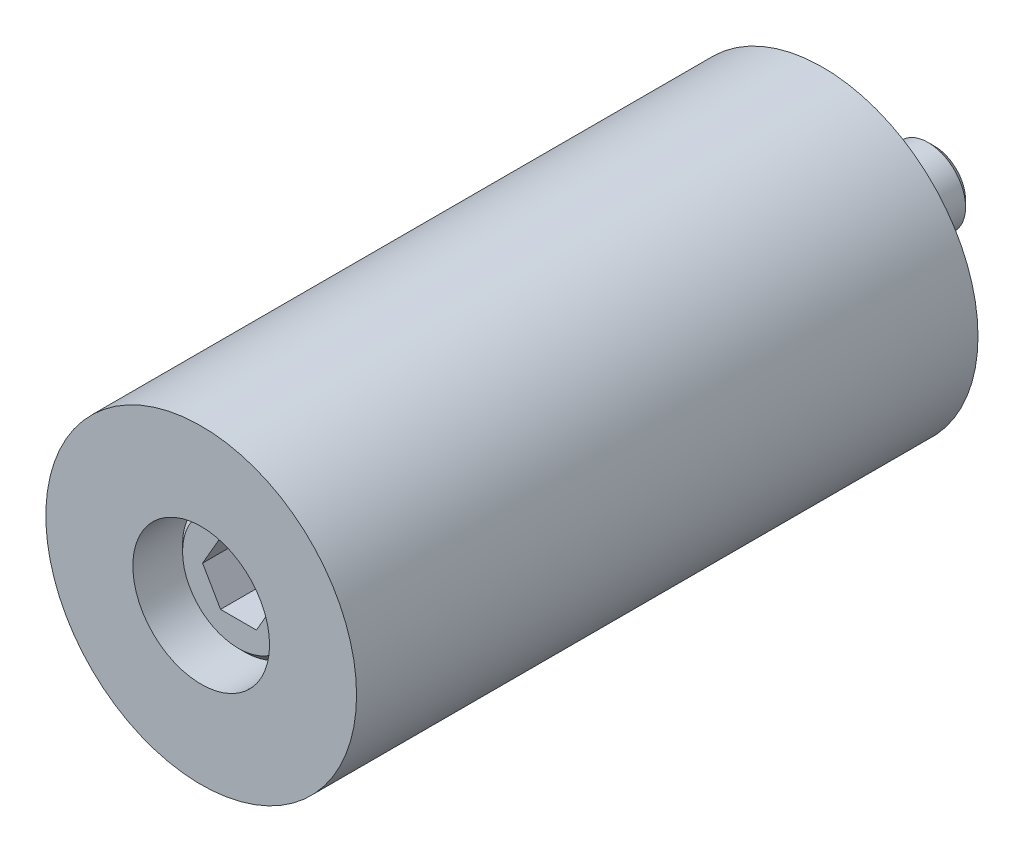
ISO-10303-21;
HEADER;
FILE_DESCRIPTION(('STEP AP214'),'2;1');
FILE_NAME('part.step','',(''),(''),'','','');
FILE_SCHEMA(('AUTOMOTIVE_DESIGN { 1 0 10303 214 1 1 1 1 }'));
ENDSEC;
DATA;
#1=APPLICATION_CONTEXT('core data for automotive mechanical design processes');
#2=APPLICATION_PROTOCOL_DEFINITION('international standard','automotive_design',2000,#1);
#3=PRODUCT_CONTEXT('',#1,'mechanical');
#4=PRODUCT('Part','Part','',(#3));
#5=PRODUCT_RELATED_PRODUCT_CATEGORY('part','',(#4));
#6=PRODUCT_DEFINITION_FORMATION('','',#4);
#7=PRODUCT_DEFINITION_CONTEXT('part definition',#1,'design');
#8=PRODUCT_DEFINITION('design','',#6,#7);
#9=PRODUCT_DEFINITION_SHAPE('','',#8);
#10=(LENGTH_UNIT() NAMED_UNIT(*) SI_UNIT(.MILLI.,.METRE.));
#11=(NAMED_UNIT(*) PLANE_ANGLE_UNIT() SI_UNIT($,.RADIAN.));
#12=(NAMED_UNIT(*) SI_UNIT($,.STERADIAN.) SOLID_ANGLE_UNIT());
#13=UNCERTAINTY_MEASURE_WITH_UNIT(LENGTH_MEASURE(1.E-05),#10,'distance_accuracy_value','');
#14=(GEOMETRIC_REPRESENTATION_CONTEXT(3) GLOBAL_UNCERTAINTY_ASSIGNED_CONTEXT((#13)) GLOBAL_UNIT_ASSIGNED_CONTEXT((#10,
#11,#12)) REPRESENTATION_CONTEXT('',''));
#15=CARTESIAN_POINT('',(0.,0.,0.));
#16=DIRECTION('',(0.,0.,1.));
#17=DIRECTION('',(1.,0.,0.));
#18=AXIS2_PLACEMENT_3D('',#15,#16,#17);
#19=CARTESIAN_POINT('',(0.,0.,25.));
#20=DIRECTION('',(0.,0.,-1.));
#21=DIRECTION('',(1.,0.,0.));
#22=AXIS2_PLACEMENT_3D('',#19,#20,#21);
#23=CYLINDRICAL_SURFACE('',#22,3.25);
#24=CARTESIAN_POINT('',(0.,0.,41.));
#25=DIRECTION('',(0.,0.,1.));
#26=DIRECTION('',(-1.,0.,0.));
#27=AXIS2_PLACEMENT_3D('',#24,#25,#26);
#28=CIRCLE('',#27,3.25);
#29=CARTESIAN_POINT('',(-3.25,0.,41.));
#30=VERTEX_POINT('',#29);
#31=CARTESIAN_POINT('',(3.25,0.,41.));
#32=VERTEX_POINT('',#31);
#33=EDGE_CURVE('P0_E36',#30,#32,#28,.T.);
#34=ORIENTED_EDGE('',*,*,#33,.T.);
#35=CARTESIAN_POINT('',(3.25,0.,41.0000015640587));
#36=CARTESIAN_POINT('',(3.25,0.,5.3315337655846E-07));
#37=B_SPLINE_CURVE_WITH_KNOTS('',1,(#35,#36),.UNSPECIFIED.,.F.,.F.,(2,2),(0.0833333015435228,
0.916666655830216),.UNSPECIFIED.);
#38=CARTESIAN_POINT('',(3.25,0.,0.));
#39=VERTEX_POINT('',#38);
#40=EDGE_CURVE('P0_E25',#32,#39,#37,.T.);
#41=ORIENTED_EDGE('',*,*,#40,.T.);
#42=CARTESIAN_POINT('',(0.,0.,0.));
#43=DIRECTION('',(0.,0.,1.));
#44=DIRECTION('',(1.,0.,0.));
#45=AXIS2_PLACEMENT_3D('',#42,#43,#44);
#46=CIRCLE('',#45,3.24999999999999);
#47=EDGE_CURVE('P0_E11',#39,#39,#46,.T.);
#48=ORIENTED_EDGE('',*,*,#47,.F.);
#49=ORIENTED_EDGE('',*,*,#40,.F.);
#50=CARTESIAN_POINT('',(0.,0.,41.));
#51=DIRECTION('',(0.,0.,1.));
#52=DIRECTION('',(-1.,0.,0.));
#53=AXIS2_PLACEMENT_3D('',#50,#51,#52);
#54=CIRCLE('',#53,3.25);
#55=EDGE_CURVE('P0_E51',#32,#30,#54,.T.);
#56=ORIENTED_EDGE('',*,*,#55,.T.);
#57=EDGE_LOOP('',(#34,#41,#48,#49,#56));
#58=FACE_BOUND('',#57,.T.);
#59=ADVANCED_FACE('P0_F16',(#58),#23,.F.);
#60=CARTESIAN_POINT('',(0.,0.,45.5));
#61=DIRECTION('',(0.,0.,-1.));
#62=DIRECTION('',(1.,0.,0.));
#63=AXIS2_PLACEMENT_3D('',#60,#61,#62);
#64=CYLINDRICAL_SURFACE('',#63,5.5);
#65=CARTESIAN_POINT('',(0.,0.,50.));
#66=DIRECTION('',(0.,0.,-1.));
#67=DIRECTION('',(1.,0.,0.));
#68=AXIS2_PLACEMENT_3D('',#65,#66,#67);
#69=CIRCLE('',#68,5.5);
#70=CARTESIAN_POINT('',(5.5,0.,50.));
#71=VERTEX_POINT('',#70);
#72=EDGE_CURVE('P0_E53',#71,#71,#69,.T.);
#73=ORIENTED_EDGE('',*,*,#72,.F.);
#74=CARTESIAN_POINT('',(5.5,0.,50.0000013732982));
#75=CARTESIAN_POINT('',(5.5,0.,40.9999982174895));
#76=B_SPLINE_CURVE_WITH_KNOTS('',1,(#74,#75),.UNSPECIFIED.,.F.,.F.,(2,2),(0.0833332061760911,
0.916666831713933),.UNSPECIFIED.);
#77=CARTESIAN_POINT('',(5.5,0.,41.));
#78=VERTEX_POINT('',#77);
#79=EDGE_CURVE('P0_E91',#71,#78,#76,.T.);
#80=ORIENTED_EDGE('',*,*,#79,.T.);
#81=CARTESIAN_POINT('',(0.,0.,41.));
#82=DIRECTION('',(0.,0.,-1.));
#83=DIRECTION('',(1.,0.,0.));
#84=AXIS2_PLACEMENT_3D('',#81,#82,#83);
#85=CIRCLE('',#84,5.5);
#86=EDGE_CURVE('P0_E94',#78,#78,#85,.T.);
#87=ORIENTED_EDGE('',*,*,#86,.T.);
#88=ORIENTED_EDGE('',*,*,#79,.F.);
#89=EDGE_LOOP('',(#73,#80,#87,#88));
#90=FACE_BOUND('',#89,.T.);
#91=ADVANCED_FACE('P0_F111',(#90),#64,.F.);
#92=CARTESIAN_POINT('',(-12.65,11.4315353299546,41.));
#93=DIRECTION('',(0.,0.,-1.));
#94=DIRECTION('',(1.,0.,0.));
#95=AXIS2_PLACEMENT_3D('',#92,#93,#94);
#96=PLANE('',#95);
#97=ORIENTED_EDGE('',*,*,#86,.F.);
#98=EDGE_LOOP('',(#97));
#99=FACE_BOUND('',#98,.T.);
#100=ORIENTED_EDGE('',*,*,#55,.F.);
#101=ORIENTED_EDGE('',*,*,#33,.F.);
#102=EDGE_LOOP('',(#100,#101));
#103=FACE_BOUND('',#102,.T.);
#104=ADVANCED_FACE('P0_F55',(#99,#103),#96,.F.);
#105=CARTESIAN_POINT('',(0.,0.,25.));
#106=DIRECTION('',(0.,0.,1.));
#107=DIRECTION('',(1.,0.,0.));
#108=AXIS2_PLACEMENT_3D('',#105,#106,#107);
#109=CYLINDRICAL_SURFACE('',#108,12.5);
#110=CARTESIAN_POINT('',(0.,0.,0.));
#111=DIRECTION('',(0.,0.,-1.));
#112=DIRECTION('',(1.,0.,0.));
#113=AXIS2_PLACEMENT_3D('',#110,#111,#112);
#114=CIRCLE('',#113,12.5);
#115=CARTESIAN_POINT('',(12.5,0.,0.));
#116=VERTEX_POINT('',#115);
#117=EDGE_CURVE('P0_E85',#116,#116,#114,.T.);
#118=ORIENTED_EDGE('',*,*,#117,.F.);
#119=CARTESIAN_POINT('',(12.5,0.,9.53634315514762E-07));
#120=CARTESIAN_POINT('',(12.5,0.,50.0000022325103));
#121=B_SPLINE_CURVE_WITH_KNOTS('',1,(#119,#120),.UNSPECIFIED.,.F.,.F.,(2,2),(0.0833333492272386,
0.916666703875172),.UNSPECIFIED.);
#122=CARTESIAN_POINT('',(12.5,0.,50.));
#123=VERTEX_POINT('',#122);
#124=EDGE_CURVE('P0_E57',#116,#123,#121,.T.);
#125=ORIENTED_EDGE('',*,*,#124,.T.);
#126=CARTESIAN_POINT('',(0.,0.,50.));
#127=DIRECTION('',(0.,0.,1.));
#128=DIRECTION('',(1.,0.,0.));
#129=AXIS2_PLACEMENT_3D('',#126,#127,#128);
#130=CIRCLE('',#129,12.5);
#131=EDGE_CURVE('P0_E82',#123,#123,#130,.T.);
#132=ORIENTED_EDGE('',*,*,#131,.F.);
#133=ORIENTED_EDGE('',*,*,#124,.F.);
#134=EDGE_LOOP('',(#118,#125,#132,#133));
#135=FACE_BOUND('',#134,.T.);
#136=ADVANCED_FACE('P0_F130',(#135),#109,.T.);
#137=CARTESIAN_POINT('',(16.25,-25.9807621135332,0.));
#138=DIRECTION('',(0.,0.,-1.));
#139=DIRECTION('',(-1.,0.,0.));
#140=AXIS2_PLACEMENT_3D('',#137,#138,#139);
#141=PLANE('',#140);
#142=ORIENTED_EDGE('',*,*,#117,.T.);
#143=EDGE_LOOP('',(#142));
#144=FACE_BOUND('',#143,.T.);
#145=ORIENTED_EDGE('',*,*,#47,.T.);
#146=EDGE_LOOP('',(#145));
#147=FACE_BOUND('',#146,.T.);
#148=ADVANCED_FACE('P0_F132',(#144,#147),#141,.T.);
#149=CARTESIAN_POINT('',(-28.75,-25.9807621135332,50.));
#150=DIRECTION('',(0.,0.,1.));
#151=DIRECTION('',(1.,0.,0.));
#152=AXIS2_PLACEMENT_3D('',#149,#150,#151);
#153=PLANE('',#152);
#154=ORIENTED_EDGE('',*,*,#131,.T.);
#155=EDGE_LOOP('',(#154));
#156=FACE_BOUND('',#155,.T.);
#157=ORIENTED_EDGE('',*,*,#72,.T.);
#158=EDGE_LOOP('',(#157));
#159=FACE_BOUND('',#158,.T.);
#160=ADVANCED_FACE('P0_F108',(#156,#159),#153,.T.);
#161=CLOSED_SHELL('',(#59,#91,#104,#136,#148,#160));
#162=MANIFOLD_SOLID_BREP('P0_B1',#161);
#163=CARTESIAN_POINT('',(0.,0.,-7.25735931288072));
#164=DIRECTION('',(0.,0.,1.));
#165=DIRECTION('',(-1.,0.,0.));
#166=AXIS2_PLACEMENT_3D('',#163,#164,#165);
#167=CONICAL_SURFACE('',#166,4.24264068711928,0.785398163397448);
#168=CARTESIAN_POINT('',(0.,0.,-9.));
#169=DIRECTION('',(0.,0.,1.));
#170=DIRECTION('',(1.,0.,0.));
#171=AXIS2_PLACEMENT_3D('',#168,#169,#170);
#172=CIRCLE('',#171,2.5);
#173=CARTESIAN_POINT('',(2.5,0.,-9.));
#174=VERTEX_POINT('',#173);
#175=CARTESIAN_POINT('',(-2.5,0.,-9.));
#176=VERTEX_POINT('',#175);
#177=EDGE_CURVE('P1_E37',#174,#176,#172,.T.);
#178=ORIENTED_EDGE('',*,*,#177,.T.);
#179=CARTESIAN_POINT('',(-2.49999945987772,0.,-9.00000054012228));
#180=CARTESIAN_POINT('',(-2.9999979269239,0.,-8.5000020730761));
#181=B_SPLINE_CURVE_WITH_KNOTS('',1,(#179,#180),.UNSPECIFIED.,.F.,.F.,(2,2),(0.589255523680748,
0.707106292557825),.UNSPECIFIED.);
#182=CARTESIAN_POINT('',(-3.,0.,-8.5));
#183=VERTEX_POINT('',#182);
#184=EDGE_CURVE('P1_E24',#176,#183,#181,.T.);
#185=ORIENTED_EDGE('',*,*,#184,.T.);
#186=CARTESIAN_POINT('',(0.,0.,-8.5));
#187=DIRECTION('',(0.,0.,-1.));
#188=DIRECTION('',(1.,0.,0.));
#189=AXIS2_PLACEMENT_3D('',#186,#187,#188);
#190=CIRCLE('',#189,3.);
#191=CARTESIAN_POINT('',(3.,0.,-8.5));
#192=VERTEX_POINT('',#191);
#193=EDGE_CURVE('P1_E173',#183,#192,#190,.T.);
#194=ORIENTED_EDGE('',*,*,#193,.T.);
#195=CARTESIAN_POINT('',(0.,0.,-8.5));
#196=DIRECTION('',(0.,0.,-1.));
#197=DIRECTION('',(1.,0.,0.));
#198=AXIS2_PLACEMENT_3D('',#195,#196,#197);
#199=CIRCLE('',#198,3.);
#200=EDGE_CURVE('P1_E10',#192,#183,#199,.T.);
#201=ORIENTED_EDGE('',*,*,#200,.T.);
#202=ORIENTED_EDGE('',*,*,#184,.F.);
#203=CARTESIAN_POINT('',(0.,0.,-9.));
#204=DIRECTION('',(0.,0.,1.));
#205=DIRECTION('',(1.,0.,0.));
#206=AXIS2_PLACEMENT_3D('',#203,#204,#205);
#207=CIRCLE('',#206,2.5);
#208=EDGE_CURVE('P1_E146',#176,#174,#207,.T.);
#209=ORIENTED_EDGE('',*,*,#208,.T.);
#210=EDGE_LOOP('',(#178,#185,#194,#201,#202,#209));
#211=FACE_BOUND('',#210,.T.);
#212=ADVANCED_FACE('P1_F15',(#211),#167,.T.);
#213=CARTESIAN_POINT('',(0.,0.,16.));
#214=DIRECTION('',(0.,0.,-1.));
#215=DIRECTION('',(1.,0.,0.));
#216=AXIS2_PLACEMENT_3D('',#213,#214,#215);
#217=CYLINDRICAL_SURFACE('',#216,3.);
#218=CARTESIAN_POINT('',(0.,0.,41.));
#219=DIRECTION('',(0.,0.,1.));
#220=DIRECTION('',(1.,0.,0.));
#221=AXIS2_PLACEMENT_3D('',#218,#219,#220);
#222=CIRCLE('',#221,3.);
#223=CARTESIAN_POINT('',(3.,0.,41.));
#224=VERTEX_POINT('',#223);
#225=EDGE_CURVE('P1_E154',#224,#224,#222,.T.);
#226=ORIENTED_EDGE('',*,*,#225,.F.);
#227=CARTESIAN_POINT('',(3.,0.,40.999999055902));
#228=CARTESIAN_POINT('',(3.,0.,-8.50000221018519));
#229=B_SPLINE_CURVE_WITH_KNOTS('',1,(#227,#228),.UNSPECIFIED.,.F.,.F.,(2,2),(0.0833333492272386,
0.916666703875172),.UNSPECIFIED.);
#230=EDGE_CURVE('P1_E127',#224,#192,#229,.T.);
#231=ORIENTED_EDGE('',*,*,#230,.T.);
#232=ORIENTED_EDGE('',*,*,#193,.F.);
#233=ORIENTED_EDGE('',*,*,#200,.F.);
#234=ORIENTED_EDGE('',*,*,#230,.F.);
#235=EDGE_LOOP('',(#226,#231,#232,#233,#234));
#236=FACE_BOUND('',#235,.T.);
#237=ADVANCED_FACE('P1_F337',(#236),#217,.T.);
#238=CARTESIAN_POINT('',(-5.75,5.19615242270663,-9.));
#239=DIRECTION('',(0.,0.,-1.));
#240=DIRECTION('',(1.,0.,0.));
#241=AXIS2_PLACEMENT_3D('',#238,#239,#240);
#242=PLANE('',#241);
#243=ORIENTED_EDGE('',*,*,#208,.F.);
#244=ORIENTED_EDGE('',*,*,#177,.F.);
#245=EDGE_LOOP('',(#243,#244));
#246=FACE_BOUND('',#245,.T.);
#247=ADVANCED_FACE('P1_F340',(#246),#242,.T.);
#248=CARTESIAN_POINT('',(0.,0.,44.4289321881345));
#249=DIRECTION('',(0.,0.,-1.));
#250=DIRECTION('',(-1.,0.,0.));
#251=AXIS2_PLACEMENT_3D('',#248,#249,#250);
#252=CONICAL_SURFACE('',#251,7.07106781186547,0.785398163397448);
#253=CARTESIAN_POINT('',(0.,0.,47.));
#254=DIRECTION('',(0.,0.,-1.));
#255=DIRECTION('',(1.,0.,0.));
#256=AXIS2_PLACEMENT_3D('',#253,#254,#255);
#257=CIRCLE('',#256,4.5);
#258=CARTESIAN_POINT('',(4.5,0.,47.));
#259=VERTEX_POINT('',#258);
#260=CARTESIAN_POINT('',(-4.5,0.,47.));
#261=VERTEX_POINT('',#260);
#262=EDGE_CURVE('P1_E102',#259,#261,#257,.T.);
#263=ORIENTED_EDGE('',*,*,#262,.T.);
#264=CARTESIAN_POINT('',(-4.50000215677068,0.,46.9999978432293));
#265=CARTESIAN_POINT('',(-5.00000242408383,0.,46.4999975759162));
#266=B_SPLINE_CURVE_WITH_KNOTS('',1,(#264,#265),.UNSPECIFIED.,.F.,.F.,(2,2),(0.636396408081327,
0.70710712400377),.UNSPECIFIED.);
#267=CARTESIAN_POINT('',(-5.,0.,46.5));
#268=VERTEX_POINT('',#267);
#269=EDGE_CURVE('P1_E107',#261,#268,#266,.T.);
#270=ORIENTED_EDGE('',*,*,#269,.T.);
#271=CARTESIAN_POINT('',(0.,0.,46.5));
#272=DIRECTION('',(0.,0.,1.));
#273=DIRECTION('',(1.,0.,0.));
#274=AXIS2_PLACEMENT_3D('',#271,#272,#273);
#275=CIRCLE('',#274,5.);
#276=CARTESIAN_POINT('',(5.,0.,46.5));
#277=VERTEX_POINT('',#276);
#278=EDGE_CURVE('P1_E117',#268,#277,#275,.T.);
#279=ORIENTED_EDGE('',*,*,#278,.T.);
#280=CARTESIAN_POINT('',(0.,0.,46.5));
#281=DIRECTION('',(0.,0.,1.));
#282=DIRECTION('',(1.,0.,0.));
#283=AXIS2_PLACEMENT_3D('',#280,#281,#282);
#284=CIRCLE('',#283,5.);
#285=EDGE_CURVE('P1_E119',#277,#268,#284,.T.);
#286=ORIENTED_EDGE('',*,*,#285,.T.);
#287=ORIENTED_EDGE('',*,*,#269,.F.);
#288=CARTESIAN_POINT('',(0.,0.,47.));
#289=DIRECTION('',(0.,0.,-1.));
#290=DIRECTION('',(1.,0.,0.));
#291=AXIS2_PLACEMENT_3D('',#288,#289,#290);
#292=CIRCLE('',#291,4.5);
#293=EDGE_CURVE('P1_E109',#261,#259,#292,.T.);
#294=ORIENTED_EDGE('',*,*,#293,.T.);
#295=EDGE_LOOP('',(#263,#270,#279,#286,#287,#294));
#296=FACE_BOUND('',#295,.T.);
#297=ADVANCED_FACE('P1_F104',(#296),#252,.T.);
#298=CARTESIAN_POINT('',(0.,0.,44.));
#299=DIRECTION('',(0.,0.,1.));
#300=DIRECTION('',(1.,0.,0.));
#301=AXIS2_PLACEMENT_3D('',#298,#299,#300);
#302=CYLINDRICAL_SURFACE('',#301,5.);
#303=CARTESIAN_POINT('',(0.,0.,41.));
#304=DIRECTION('',(0.,0.,-1.));
#305=DIRECTION('',(1.,0.,0.));
#306=AXIS2_PLACEMENT_3D('',#303,#304,#305);
#307=CIRCLE('',#306,5.);
#308=CARTESIAN_POINT('',(5.,0.,41.));
#309=VERTEX_POINT('',#308);
#310=EDGE_CURVE('P1_E112',#309,#309,#307,.T.);
#311=ORIENTED_EDGE('',*,*,#310,.F.);
#312=CARTESIAN_POINT('',(5.,0.,41.000004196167));
#313=CARTESIAN_POINT('',(5.,0.,46.5000028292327));
#314=B_SPLINE_CURVE_WITH_KNOTS('',1,(#312,#313),.UNSPECIFIED.,.F.,.F.,(2,2),(0.0833339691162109,
0.916667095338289),.UNSPECIFIED.);
#315=EDGE_CURVE('P1_E317',#309,#277,#314,.T.);
#316=ORIENTED_EDGE('',*,*,#315,.T.);
#317=ORIENTED_EDGE('',*,*,#278,.F.);
#318=ORIENTED_EDGE('',*,*,#285,.F.);
#319=ORIENTED_EDGE('',*,*,#315,.F.);
#320=EDGE_LOOP('',(#311,#316,#317,#318,#319));
#321=FACE_BOUND('',#320,.T.);
#322=ADVANCED_FACE('P1_F348',(#321),#302,.T.);
#323=CARTESIAN_POINT('',(-10.35,-9.35307436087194,47.));
#324=DIRECTION('',(0.,0.,1.));
#325=DIRECTION('',(1.,0.,0.));
#326=AXIS2_PLACEMENT_3D('',#323,#324,#325);
#327=PLANE('',#326);
#328=ORIENTED_EDGE('',*,*,#293,.F.);
#329=ORIENTED_EDGE('',*,*,#262,.F.);
#330=EDGE_LOOP('',(#328,#329));
#331=FACE_BOUND('',#330,.T.);
#332=DIRECTION('',(-0.500000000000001,0.866025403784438,0.));
#333=VECTOR('',#332,1.);
#334=CARTESIAN_POINT('',(-1.44337567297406,-2.5,47.));
#335=LINE('',#334,#333);
#336=CARTESIAN_POINT('',(-1.44337567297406,-2.5,47.));
#337=VERTEX_POINT('',#336);
#338=CARTESIAN_POINT('',(-2.88675134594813,0.,47.));
#339=VERTEX_POINT('',#338);
#340=EDGE_CURVE('P1_E312',#337,#339,#335,.T.);
#341=ORIENTED_EDGE('',*,*,#340,.T.);
#342=DIRECTION('',(0.5,0.866025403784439,0.));
#343=VECTOR('',#342,1.);
#344=CARTESIAN_POINT('',(-2.88675134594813,0.,47.));
#345=LINE('',#344,#343);
#346=CARTESIAN_POINT('',(-1.44337567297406,2.5,47.));
#347=VERTEX_POINT('',#346);
#348=EDGE_CURVE('P1_E306',#339,#347,#345,.T.);
#349=ORIENTED_EDGE('',*,*,#348,.T.);
#350=DIRECTION('',(1.,0.,0.));
#351=VECTOR('',#350,1.);
#352=CARTESIAN_POINT('',(-1.44337567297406,2.5,47.));
#353=LINE('',#352,#351);
#354=CARTESIAN_POINT('',(1.44337567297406,2.5,47.));
#355=VERTEX_POINT('',#354);
#356=EDGE_CURVE('P1_E300',#347,#355,#353,.T.);
#357=ORIENTED_EDGE('',*,*,#356,.T.);
#358=DIRECTION('',(0.500000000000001,-0.866025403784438,0.));
#359=VECTOR('',#358,1.);
#360=CARTESIAN_POINT('',(1.44337567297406,2.5,47.));
#361=LINE('',#360,#359);
#362=CARTESIAN_POINT('',(2.88675134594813,0.,47.));
#363=VERTEX_POINT('',#362);
#364=EDGE_CURVE('P1_E294',#355,#363,#361,.T.);
#365=ORIENTED_EDGE('',*,*,#364,.T.);
#366=DIRECTION('',(-0.499999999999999,-0.866025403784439,0.));
#367=VECTOR('',#366,1.);
#368=CARTESIAN_POINT('',(2.88675134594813,0.,47.));
#369=LINE('',#368,#367);
#370=CARTESIAN_POINT('',(1.44337567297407,-2.5,47.));
#371=VERTEX_POINT('',#370);
#372=EDGE_CURVE('P1_E288',#363,#371,#369,.T.);
#373=ORIENTED_EDGE('',*,*,#372,.T.);
#374=DIRECTION('',(-1.,0.,0.));
#375=VECTOR('',#374,1.);
#376=CARTESIAN_POINT('',(1.44337567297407,-2.5,47.));
#377=LINE('',#376,#375);
#378=EDGE_CURVE('P1_E277',#371,#337,#377,.T.);
#379=ORIENTED_EDGE('',*,*,#378,.T.);
#380=EDGE_LOOP('',(#341,#349,#357,#365,#373,#379));
#381=FACE_BOUND('',#380,.T.);
#382=ADVANCED_FACE('P1_F114',(#331,#381),#327,.T.);
#383=CARTESIAN_POINT('',(0.,0.,44.5600391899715));
#384=DIRECTION('',(0.,0.,1.));
#385=DIRECTION('',(-1.,0.,0.));
#386=AXIS2_PLACEMENT_3D('',#383,#384,#385);
#387=CONICAL_SURFACE('',#386,3.81881307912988,1.02974425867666);
#388=CARTESIAN_POINT('',(0.,0.,42.275464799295));
#389=DIRECTION('',(0.,0.,-1.));
#390=DIRECTION('',(-1.,0.,0.));
#391=AXIS2_PLACEMENT_3D('',#388,#389,#390);
#392=CIRCLE('',#391,0.0166427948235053);
#393=CARTESIAN_POINT('',(-0.0166427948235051,0.,42.275464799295));
#394=VERTEX_POINT('',#393);
#395=EDGE_CURVE('P1_E216',#394,#394,#392,.T.);
#396=ORIENTED_EDGE('',*,*,#395,.T.);
#397=CARTESIAN_POINT('',(-0.0166398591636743,0.,42.2754630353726));
#398=CARTESIAN_POINT('',(-2.88675167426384,0.,44.000000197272));
#399=B_SPLINE_CURVE_WITH_KNOTS('',1,(#397,#398),.UNSPECIFIED.,.F.,.F.,(2,2),(0.0043573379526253,
0.755929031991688),.UNSPECIFIED.);
#400=CARTESIAN_POINT('',(-2.88675134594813,0.,44.));
#401=VERTEX_POINT('',#400);
#402=EDGE_CURVE('P1_E221',#394,#401,#399,.T.);
#403=ORIENTED_EDGE('',*,*,#402,.T.);
#404=CARTESIAN_POINT('',(-2.88675134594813,0.,44.));
#405=CARTESIAN_POINT('',(-2.1650635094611,-1.25,43.5663661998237));
#406=CARTESIAN_POINT('',(-1.44337567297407,-2.5,44.));
#407=(BOUNDED_CURVE() B_SPLINE_CURVE(2,(#404,#405,#406),.UNSPECIFIED.,.F.,
.F.) B_SPLINE_CURVE_WITH_KNOTS((3,3),(0.,2.92392578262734),
.UNSPECIFIED.) CURVE() GEOMETRIC_REPRESENTATION_ITEM() RATIONAL_B_SPLINE_CURVE((1.,
1.15470053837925,1.)) REPRESENTATION_ITEM(''));
#408=CARTESIAN_POINT('',(-1.44337567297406,-2.5,44.));
#409=VERTEX_POINT('',#408);
#410=EDGE_CURVE('P1_E227',#401,#409,#407,.T.);
#411=ORIENTED_EDGE('',*,*,#410,.T.);
#412=CARTESIAN_POINT('',(-1.44337567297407,-2.5,44.));
#413=CARTESIAN_POINT('',(0.,-2.5,43.5663661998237));
#414=CARTESIAN_POINT('',(1.44337567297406,-2.5,44.));
#415=(BOUNDED_CURVE() B_SPLINE_CURVE(2,(#412,#413,#414),.UNSPECIFIED.,.F.,
.F.) B_SPLINE_CURVE_WITH_KNOTS((3,3),(0.,2.92392578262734),
.UNSPECIFIED.) CURVE() GEOMETRIC_REPRESENTATION_ITEM() RATIONAL_B_SPLINE_CURVE((1.,
1.15470053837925,1.)) REPRESENTATION_ITEM(''));
#416=CARTESIAN_POINT('',(1.44337567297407,-2.5,44.));
#417=VERTEX_POINT('',#416);
#418=EDGE_CURVE('P1_E224',#409,#417,#415,.T.);
#419=ORIENTED_EDGE('',*,*,#418,.T.);
#420=CARTESIAN_POINT('',(1.44337567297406,-2.5,44.));
#421=CARTESIAN_POINT('',(2.16506350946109,-1.25,43.5663661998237));
#422=CARTESIAN_POINT('',(2.88675134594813,0.,44.));
#423=(BOUNDED_CURVE() B_SPLINE_CURVE(2,(#420,#421,#422),.UNSPECIFIED.,.F.,
.F.) B_SPLINE_CURVE_WITH_KNOTS((3,3),(0.,2.92392578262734),
.UNSPECIFIED.) CURVE() GEOMETRIC_REPRESENTATION_ITEM() RATIONAL_B_SPLINE_CURVE((1.,
1.15470053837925,1.)) REPRESENTATION_ITEM(''));
#424=CARTESIAN_POINT('',(2.88675134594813,0.,44.));
#425=VERTEX_POINT('',#424);
#426=EDGE_CURVE('P1_E267',#417,#425,#423,.T.);
#427=ORIENTED_EDGE('',*,*,#426,.T.);
#428=CARTESIAN_POINT('',(2.88675134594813,0.,44.));
#429=CARTESIAN_POINT('',(2.1650635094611,1.25,43.5663661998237));
#430=CARTESIAN_POINT('',(1.44337567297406,2.5,44.));
#431=(BOUNDED_CURVE() B_SPLINE_CURVE(2,(#428,#429,#430),.UNSPECIFIED.,.F.,
.F.) B_SPLINE_CURVE_WITH_KNOTS((3,3),(0.,2.92392578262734),
.UNSPECIFIED.) CURVE() GEOMETRIC_REPRESENTATION_ITEM() RATIONAL_B_SPLINE_CURVE((1.,
1.15470053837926,1.)) REPRESENTATION_ITEM(''));
#432=CARTESIAN_POINT('',(1.44337567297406,2.5,44.));
#433=VERTEX_POINT('',#432);
#434=EDGE_CURVE('P1_E257',#425,#433,#431,.T.);
#435=ORIENTED_EDGE('',*,*,#434,.T.);
#436=CARTESIAN_POINT('',(1.44337567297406,2.5,44.));
#437=CARTESIAN_POINT('',(0.,2.5,43.5663661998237));
#438=CARTESIAN_POINT('',(-1.44337567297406,2.5,44.));
#439=(BOUNDED_CURVE() B_SPLINE_CURVE(2,(#436,#437,#438),.UNSPECIFIED.,.F.,
.F.) B_SPLINE_CURVE_WITH_KNOTS((3,3),(0.,2.92392578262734),
.UNSPECIFIED.) CURVE() GEOMETRIC_REPRESENTATION_ITEM() RATIONAL_B_SPLINE_CURVE((1.,
1.15470053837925,1.)) REPRESENTATION_ITEM(''));
#440=CARTESIAN_POINT('',(-1.44337567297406,2.5,44.));
#441=VERTEX_POINT('',#440);
#442=EDGE_CURVE('P1_E247',#433,#441,#439,.T.);
#443=ORIENTED_EDGE('',*,*,#442,.T.);
#444=CARTESIAN_POINT('',(-1.44337567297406,2.5,44.));
#445=CARTESIAN_POINT('',(-2.1650635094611,1.25,43.5663661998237));
#446=CARTESIAN_POINT('',(-2.88675134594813,0.,44.));
#447=(BOUNDED_CURVE() B_SPLINE_CURVE(2,(#444,#445,#446),.UNSPECIFIED.,.F.,
.F.) B_SPLINE_CURVE_WITH_KNOTS((3,3),(0.,2.92392578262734),
.UNSPECIFIED.) CURVE() GEOMETRIC_REPRESENTATION_ITEM() RATIONAL_B_SPLINE_CURVE((1.,
1.15470053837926,1.)) REPRESENTATION_ITEM(''));
#448=EDGE_CURVE('P1_E237',#441,#401,#447,.T.);
#449=ORIENTED_EDGE('',*,*,#448,.T.);
#450=ORIENTED_EDGE('',*,*,#402,.F.);
#451=EDGE_LOOP('',(#396,#403,#411,#419,#427,#435,#443,#449,#450));
#452=FACE_BOUND('',#451,.T.);
#453=ADVANCED_FACE('P1_F390',(#452),#387,.F.);
#454=CARTESIAN_POINT('',(0.0382784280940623,-0.0345913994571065,42.275464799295));
#455=DIRECTION('',(0.,0.,-1.));
#456=DIRECTION('',(-1.,0.,0.));
#457=AXIS2_PLACEMENT_3D('',#454,#455,#456);
#458=PLANE('',#457);
#459=ORIENTED_EDGE('',*,*,#395,.F.);
#460=EDGE_LOOP('',(#459));
#461=FACE_BOUND('',#460,.T.);
#462=ADVANCED_FACE('P1_F398',(#461),#458,.F.);
#463=CARTESIAN_POINT('',(-1.29903810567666,-2.75,47.3433633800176));
#464=DIRECTION('',(-0.866025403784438,-0.5,0.));
#465=DIRECTION('',(-0.5,0.866025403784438,0.));
#466=AXIS2_PLACEMENT_3D('',#463,#464,#465);
#467=PLANE('',#466);
#468=DIRECTION('',(0.,0.,-1.));
#469=VECTOR('',#468,1.);
#470=CARTESIAN_POINT('',(-2.88675134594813,0.,47.));
#471=LINE('',#470,#469);
#472=EDGE_CURVE('P1_E210',#339,#401,#471,.T.);
#473=ORIENTED_EDGE('',*,*,#472,.F.);
#474=ORIENTED_EDGE('',*,*,#340,.F.);
#475=DIRECTION('',(0.,0.,-1.));
#476=VECTOR('',#475,1.);
#477=CARTESIAN_POINT('',(-1.44337567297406,-2.5,47.));
#478=LINE('',#477,#476);
#479=EDGE_CURVE('P1_E204',#337,#409,#478,.T.);
#480=ORIENTED_EDGE('',*,*,#479,.T.);
#481=ORIENTED_EDGE('',*,*,#410,.F.);
#482=EDGE_LOOP('',(#473,#474,#480,#481));
#483=FACE_BOUND('',#482,.T.);
#484=ADVANCED_FACE('P1_F407',(#483),#467,.F.);
#485=CARTESIAN_POINT('',(1.73205080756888,-2.5,47.3433633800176));
#486=DIRECTION('',(0.,-1.,0.));
#487=DIRECTION('',(-1.,0.,0.));
#488=AXIS2_PLACEMENT_3D('',#485,#486,#487);
#489=PLANE('',#488);
#490=ORIENTED_EDGE('',*,*,#479,.F.);
#491=ORIENTED_EDGE('',*,*,#378,.F.);
#492=DIRECTION('',(0.,0.,-1.));
#493=VECTOR('',#492,1.);
#494=CARTESIAN_POINT('',(1.44337567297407,-2.5,47.));
#495=LINE('',#494,#493);
#496=EDGE_CURVE('P1_E198',#371,#417,#495,.T.);
#497=ORIENTED_EDGE('',*,*,#496,.T.);
#498=ORIENTED_EDGE('',*,*,#418,.F.);
#499=EDGE_LOOP('',(#490,#491,#497,#498));
#500=FACE_BOUND('',#499,.T.);
#501=ADVANCED_FACE('P1_F416',(#500),#489,.F.);
#502=CARTESIAN_POINT('',(3.03108891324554,0.250000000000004,47.3433633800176));
#503=DIRECTION('',(0.866025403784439,-0.499999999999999,0.));
#504=DIRECTION('',(-0.499999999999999,-0.866025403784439,0.));
#505=AXIS2_PLACEMENT_3D('',#502,#503,#504);
#506=PLANE('',#505);
#507=ORIENTED_EDGE('',*,*,#496,.F.);
#508=ORIENTED_EDGE('',*,*,#372,.F.);
#509=DIRECTION('',(0.,0.,-1.));
#510=VECTOR('',#509,1.);
#511=CARTESIAN_POINT('',(2.88675134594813,0.,47.));
#512=LINE('',#511,#510);
#513=EDGE_CURVE('P1_E192',#363,#425,#512,.T.);
#514=ORIENTED_EDGE('',*,*,#513,.T.);
#515=ORIENTED_EDGE('',*,*,#426,.F.);
#516=EDGE_LOOP('',(#507,#508,#514,#515));
#517=FACE_BOUND('',#516,.T.);
#518=ADVANCED_FACE('P1_F425',(#517),#506,.F.);
#519=CARTESIAN_POINT('',(1.29903810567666,2.75,47.3433633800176));
#520=DIRECTION('',(0.866025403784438,0.500000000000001,0.));
#521=DIRECTION('',(0.500000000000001,-0.866025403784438,0.));
#522=AXIS2_PLACEMENT_3D('',#519,#520,#521);
#523=PLANE('',#522);
#524=ORIENTED_EDGE('',*,*,#513,.F.);
#525=ORIENTED_EDGE('',*,*,#364,.F.);
#526=DIRECTION('',(0.,0.,-1.));
#527=VECTOR('',#526,1.);
#528=CARTESIAN_POINT('',(1.44337567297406,2.5,47.));
#529=LINE('',#528,#527);
#530=EDGE_CURVE('P1_E186',#355,#433,#529,.T.);
#531=ORIENTED_EDGE('',*,*,#530,.T.);
#532=ORIENTED_EDGE('',*,*,#434,.F.);
#533=EDGE_LOOP('',(#524,#525,#531,#532));
#534=FACE_BOUND('',#533,.T.);
#535=ADVANCED_FACE('P1_F434',(#534),#523,.F.);
#536=CARTESIAN_POINT('',(-1.73205080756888,2.5,47.3433633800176));
#537=DIRECTION('',(0.,1.,0.));
#538=DIRECTION('',(1.,0.,0.));
#539=AXIS2_PLACEMENT_3D('',#536,#537,#538);
#540=PLANE('',#539);
#541=ORIENTED_EDGE('',*,*,#530,.F.);
#542=ORIENTED_EDGE('',*,*,#356,.F.);
#543=DIRECTION('',(0.,0.,-1.));
#544=VECTOR('',#543,1.);
#545=CARTESIAN_POINT('',(-1.44337567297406,2.5,47.));
#546=LINE('',#545,#544);
#547=EDGE_CURVE('P1_E178',#347,#441,#546,.T.);
#548=ORIENTED_EDGE('',*,*,#547,.T.);
#549=ORIENTED_EDGE('',*,*,#442,.F.);
#550=EDGE_LOOP('',(#541,#542,#548,#549));
#551=FACE_BOUND('',#550,.T.);
#552=ADVANCED_FACE('P1_F443',(#551),#540,.F.);
#553=CARTESIAN_POINT('',(-3.03108891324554,-0.250000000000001,47.3433633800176));
#554=DIRECTION('',(-0.866025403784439,0.5,0.));
#555=DIRECTION('',(0.5,0.866025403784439,0.));
#556=AXIS2_PLACEMENT_3D('',#553,#554,#555);
#557=PLANE('',#556);
#558=ORIENTED_EDGE('',*,*,#547,.F.);
#559=ORIENTED_EDGE('',*,*,#348,.F.);
#560=ORIENTED_EDGE('',*,*,#472,.T.);
#561=ORIENTED_EDGE('',*,*,#448,.F.);
#562=EDGE_LOOP('',(#558,#559,#560,#561));
#563=FACE_BOUND('',#562,.T.);
#564=ADVANCED_FACE('P1_F452',(#563),#557,.F.);
#565=CARTESIAN_POINT('',(6.5,-10.3923048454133,41.));
#566=DIRECTION('',(0.,0.,-1.));
#567=DIRECTION('',(-1.,0.,0.));
#568=AXIS2_PLACEMENT_3D('',#565,#566,#567);
#569=PLANE('',#568);
#570=ORIENTED_EDGE('',*,*,#310,.T.);
#571=EDGE_LOOP('',(#570));
#572=FACE_BOUND('',#571,.T.);
#573=ORIENTED_EDGE('',*,*,#225,.T.);
#574=EDGE_LOOP('',(#573));
#575=FACE_BOUND('',#574,.T.);
#576=ADVANCED_FACE('P1_F336',(#572,#575),#569,.T.);
#577=CLOSED_SHELL('',(#212,#237,#247,#297,#322,#382,#453,#462,#484,#501,#518,#535,#552,#564,#576));
#578=MANIFOLD_SOLID_BREP('P1_B1',#577);
#579=ADVANCED_BREP_SHAPE_REPRESENTATION('',(#18,#162,#578),#14);
#580=SHAPE_DEFINITION_REPRESENTATION(#9,#579);
ENDSEC;
END-ISO-10303-21;
